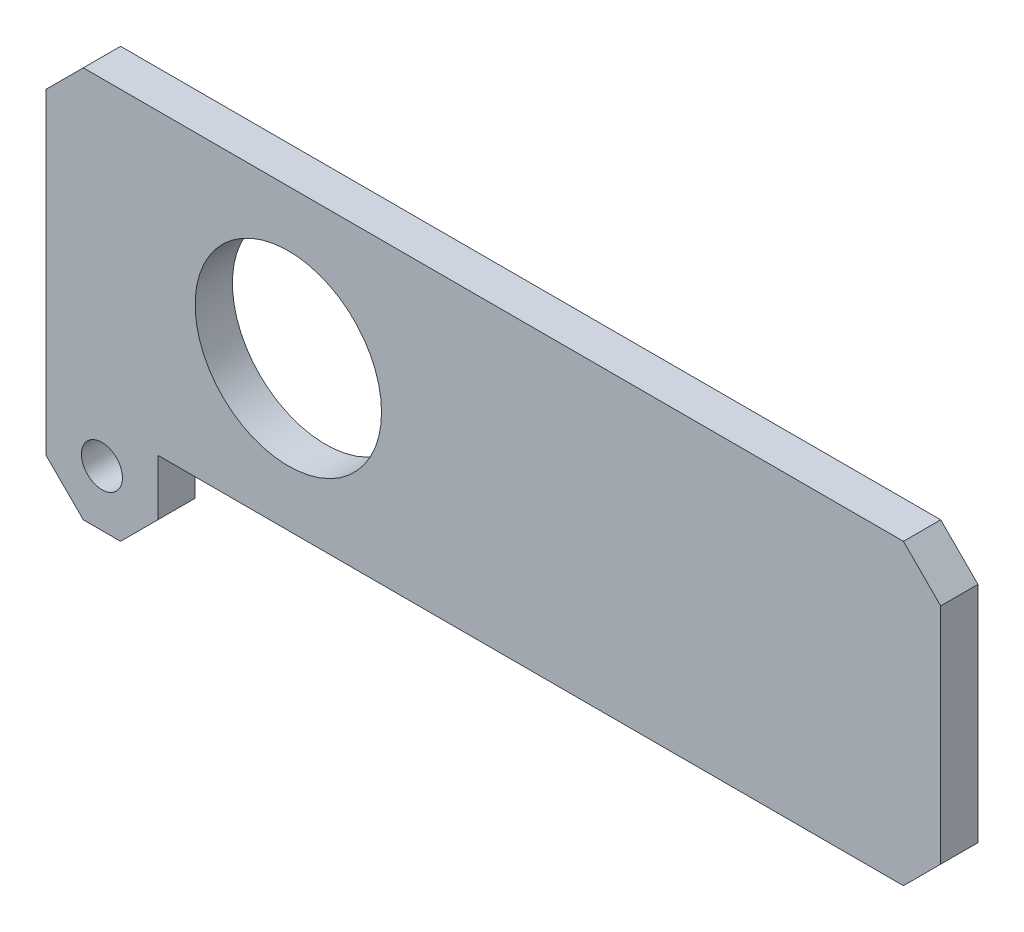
from build123d import *

# Parameters (mm, degrees)
ESQUISSE1_R      = 25
ESQUISSE1_R_2    = 5.5
EXTRUSION1_DEPTH = 10
CHANFREIN1_SIZE  = 10
CHANFREIN2_SIZE  = 10
CHANFREIN3_SIZE  = 10
CHANFREIN4_SIZE  = 10
CHANFREIN5_SIZE  = 10


with BuildPart() as part:
    # Esquisse1 → Extrusion1 (new body)
    with BuildSketch(Plane.XY):
        Polygon((0, 0), (0, 105), (240, 105), (240, 25), (30, 25), (30, 0), align=None)
        with Locations((65, 65)):
            Circle(ESQUISSE1_R, mode=Mode.SUBTRACT)
        with Locations((15, 15)):
            Circle(ESQUISSE1_R_2, mode=Mode.SUBTRACT)
    extrude(amount=EXTRUSION1_DEPTH)

    # Chanfrein1
    chanfrein1_edges = [part.edges().sort_by_distance(p)[0] for p in [
        (0, 0, 5),
    ]]
    chamfer(chanfrein1_edges, length=CHANFREIN1_SIZE)

    # Chanfrein2
    chanfrein2_edges = [part.edges().sort_by_distance(p)[0] for p in [
        (30, 0, 5),
    ]]
    chamfer(chanfrein2_edges, length=CHANFREIN2_SIZE)

    # Chanfrein3
    chanfrein3_edges = [part.edges().sort_by_distance(p)[0] for p in [
        (0, 105, 5),
    ]]
    chamfer(chanfrein3_edges, length=CHANFREIN3_SIZE)

    # Chanfrein4
    chanfrein4_edges = [part.edges().sort_by_distance(p)[0] for p in [
        (240, 105, 5),
    ]]
    chamfer(chanfrein4_edges, length=CHANFREIN4_SIZE)

    # Chanfrein5
    chanfrein5_edges = [part.edges().sort_by_distance(p)[0] for p in [
        (240, 25, 5),
    ]]
    chamfer(chanfrein5_edges, length=CHANFREIN5_SIZE)


solid = part.part
